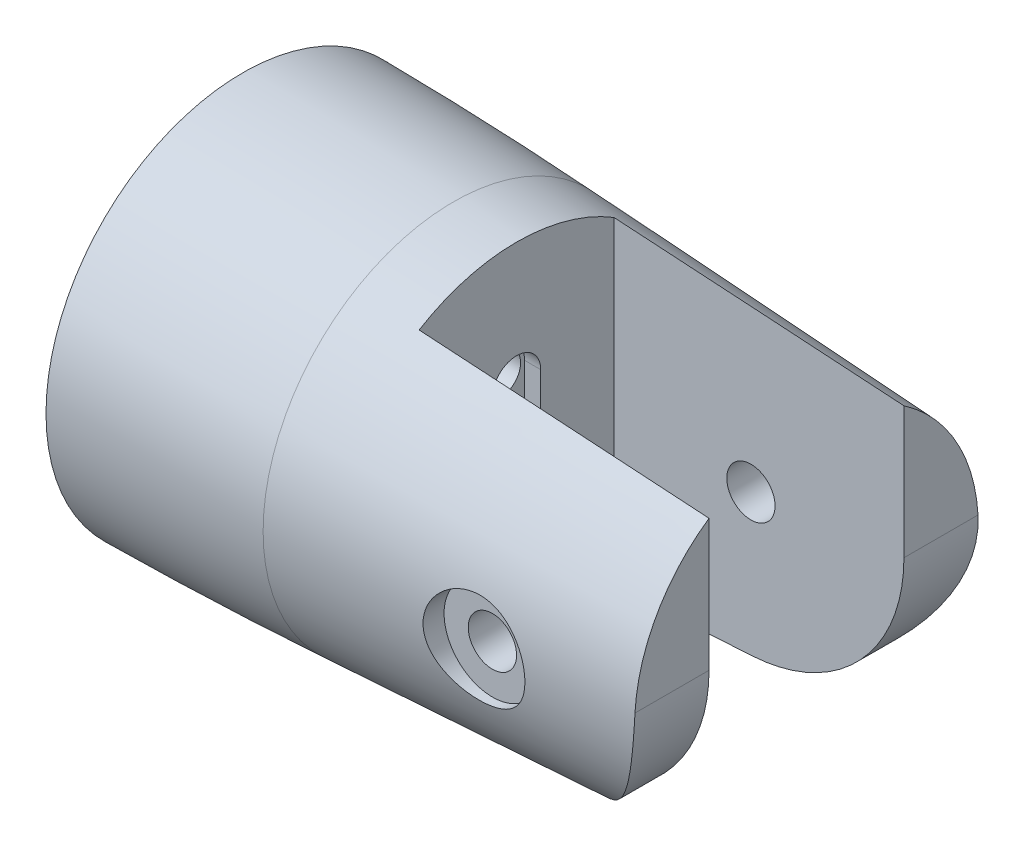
ISO-10303-21;
HEADER;
FILE_DESCRIPTION(('STEP AP214'),'2;1');
FILE_NAME('part.step','',(''),(''),'','','');
FILE_SCHEMA(('AUTOMOTIVE_DESIGN { 1 0 10303 214 1 1 1 1 }'));
ENDSEC;
DATA;
#1=APPLICATION_CONTEXT('core data for automotive mechanical design processes');
#2=APPLICATION_PROTOCOL_DEFINITION('international standard','automotive_design',2000,#1);
#3=PRODUCT_CONTEXT('',#1,'mechanical');
#4=PRODUCT('Part','Part','',(#3));
#5=PRODUCT_RELATED_PRODUCT_CATEGORY('part','',(#4));
#6=PRODUCT_DEFINITION_FORMATION('','',#4);
#7=PRODUCT_DEFINITION_CONTEXT('part definition',#1,'design');
#8=PRODUCT_DEFINITION('design','',#6,#7);
#9=PRODUCT_DEFINITION_SHAPE('','',#8);
#10=(LENGTH_UNIT() NAMED_UNIT(*) SI_UNIT(.MILLI.,.METRE.));
#11=(NAMED_UNIT(*) PLANE_ANGLE_UNIT() SI_UNIT($,.RADIAN.));
#12=(NAMED_UNIT(*) SI_UNIT($,.STERADIAN.) SOLID_ANGLE_UNIT());
#13=UNCERTAINTY_MEASURE_WITH_UNIT(LENGTH_MEASURE(1.E-05),#10,'distance_accuracy_value','');
#14=(GEOMETRIC_REPRESENTATION_CONTEXT(3) GLOBAL_UNCERTAINTY_ASSIGNED_CONTEXT((#13)) GLOBAL_UNIT_ASSIGNED_CONTEXT((#10,
#11,#12)) REPRESENTATION_CONTEXT('',''));
#15=CARTESIAN_POINT('',(0.,0.,0.));
#16=DIRECTION('',(0.,0.,1.));
#17=DIRECTION('',(1.,0.,0.));
#18=AXIS2_PLACEMENT_3D('',#15,#16,#17);
#19=CARTESIAN_POINT('',(-2.62045474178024,0.,0.));
#20=DIRECTION('',(-1.,0.,0.));
#21=DIRECTION('',(0.,0.,1.));
#22=AXIS2_PLACEMENT_3D('',#19,#20,#21);
#23=DEGENERATE_TOROIDAL_SURFACE('',#22,287.774371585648,300.,.F.);
#24=CARTESIAN_POINT('',(13.0803321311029,0.,0.));
#25=DIRECTION('',(-1.,0.,0.));
#26=DIRECTION('',(0.,0.,1.));
#27=AXIS2_PLACEMENT_3D('',#24,#25,#26);
#28=CIRCLE('',#27,11.8144888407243);
#29=CARTESIAN_POINT('',(13.0803321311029,0.,11.8144888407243));
#30=VERTEX_POINT('',#29);
#31=EDGE_CURVE('E317',#30,#30,#28,.F.);
#32=ORIENTED_EDGE('',*,*,#31,.F.);
#33=EDGE_LOOP('',(#32));
#34=FACE_BOUND('',#33,.T.);
#35=CARTESIAN_POINT('',(0.,0.,0.));
#36=DIRECTION('',(-1.,0.,0.));
#37=DIRECTION('',(0.,0.,1.));
#38=AXIS2_PLACEMENT_3D('',#35,#36,#37);
#39=CIRCLE('',#38,12.2141835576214);
#40=CARTESIAN_POINT('',(0.,0.,12.2141835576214));
#41=VERTEX_POINT('',#40);
#42=EDGE_CURVE('E174',#41,#41,#39,.F.);
#43=ORIENTED_EDGE('',*,*,#42,.T.);
#44=EDGE_LOOP('',(#43));
#45=FACE_BOUND('',#44,.T.);
#46=ADVANCED_FACE('F33',(#34,#45),#23,.F.);
#47=CARTESIAN_POINT('',(0.,0.,0.));
#48=DIRECTION('',(-1.,0.,0.));
#49=DIRECTION('',(0.,0.,-1.));
#50=AXIS2_PLACEMENT_3D('',#47,#48,#49);
#51=CONICAL_SURFACE('',#50,12.5,0.05235987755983);
#52=CARTESIAN_POINT('',(31.9092800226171,2.39438326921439,-10.5596465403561));
#53=CARTESIAN_POINT('',(29.3329511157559,2.39438326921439,-10.6980843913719));
#54=CARTESIAN_POINT('',(26.756615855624,2.39438326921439,-10.8364038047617));
#55=CARTESIAN_POINT('',(21.6039326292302,2.39438326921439,-11.1128057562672));
#56=CARTESIAN_POINT('',(19.0275846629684,2.39438326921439,-11.2508882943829));
#57=CARTESIAN_POINT('',(16.451230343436,2.39438326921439,-11.3888523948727));
#58=B_SPLINE_CURVE_WITH_KNOTS('',3,(#52,#53,#54,#55,#56,#57),.UNSPECIFIED.,.F.,.F.,(4,2,4),(0.,
7.74013699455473,15.4802739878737),.UNSPECIFIED.);
#59=CARTESIAN_POINT('',(27.2320508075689,2.39438326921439,-10.8108493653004));
#60=VERTEX_POINT('',#59);
#61=CARTESIAN_POINT('',(23.7679491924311,2.39438326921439,-10.9967211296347));
#62=VERTEX_POINT('',#61);
#63=EDGE_CURVE('E40',#60,#62,#58,.T.);
#64=ORIENTED_EDGE('',*,*,#63,.T.);
#65=CARTESIAN_POINT('',(22.1874988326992,-0.343037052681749,0.));
#66=DIRECTION('',(-0.866025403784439,0.499999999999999,0.));
#67=DIRECTION('',(-0.499999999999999,-0.866025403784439,0.));
#68=AXIS2_PLACEMENT_3D('',#65,#66,#67);
#69=ELLIPSE('',#68,13.0910737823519,11.3320115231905);
#70=CARTESIAN_POINT('',(22.0358983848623,-0.605616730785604,-11.328971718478));
#71=VERTEX_POINT('',#70);
#72=EDGE_CURVE('E11',#62,#71,#69,.T.);
#73=ORIENTED_EDGE('',*,*,#72,.T.);
#74=CARTESIAN_POINT('',(21.4875520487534,0.344146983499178,0.));
#75=DIRECTION('',(-0.866025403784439,-0.5,0.));
#76=DIRECTION('',(-0.5,0.866025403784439,0.));
#77=AXIS2_PLACEMENT_3D('',#74,#75,#76);
#78=ELLIPSE('',#77,13.1334312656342,11.3686773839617);
#79=CARTESIAN_POINT('',(23.7679491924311,-3.6056167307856,-10.6611666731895));
#80=VERTEX_POINT('',#79);
#81=EDGE_CURVE('E154',#71,#80,#78,.T.);
#82=ORIENTED_EDGE('',*,*,#81,.T.);
#83=CARTESIAN_POINT('',(16.4827479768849,-3.6056167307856,-11.0634585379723));
#84=CARTESIAN_POINT('',(19.0588843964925,-3.6056167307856,-10.9214828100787));
#85=CARTESIAN_POINT('',(21.6350044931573,-3.6056167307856,-10.7792121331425));
#86=CARTESIAN_POINT('',(26.7872120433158,-3.6056167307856,-10.4940808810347));
#87=CARTESIAN_POINT('',(29.3632994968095,-3.6056167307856,-10.3512203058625));
#88=CARTESIAN_POINT('',(31.9393706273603,-3.6056167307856,-10.2080647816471));
#89=B_SPLINE_CURVE_WITH_KNOTS('',3,(#83,#84,#85,#86,#87,#88),.UNSPECIFIED.,.F.,.F.,(4,2,4),(0.,
7.74013703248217,15.4802740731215),.UNSPECIFIED.);
#90=CARTESIAN_POINT('',(27.2320508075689,-3.6056167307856,-10.4693391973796));
#91=VERTEX_POINT('',#90);
#92=EDGE_CURVE('E627',#80,#91,#89,.T.);
#93=ORIENTED_EDGE('',*,*,#92,.T.);
#94=CARTESIAN_POINT('',(29.1220508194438,-0.332040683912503,0.));
#95=DIRECTION('',(0.866025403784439,-0.5,0.));
#96=DIRECTION('',(-0.5,-0.866025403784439,0.));
#97=AXIS2_PLACEMENT_3D('',#94,#95,#96);
#98=ELLIPSE('',#97,12.6714273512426,10.9687534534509);
#99=CARTESIAN_POINT('',(28.9641016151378,-0.605616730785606,-10.9653443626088));
#100=VERTEX_POINT('',#99);
#101=EDGE_CURVE('E624',#91,#100,#98,.T.);
#102=ORIENTED_EDGE('',*,*,#101,.T.);
#103=CARTESIAN_POINT('',(28.4221040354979,0.333150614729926,0.));
#104=DIRECTION('',(0.866025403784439,0.5,0.));
#105=DIRECTION('',(-0.5,0.866025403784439,0.));
#106=AXIS2_PLACEMENT_3D('',#103,#104,#105);
#107=ELLIPSE('',#106,12.713784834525,11.0054193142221);
#108=EDGE_CURVE('E621',#100,#60,#107,.T.);
#109=ORIENTED_EDGE('',*,*,#108,.T.);
#110=EDGE_LOOP('',(#64,#73,#82,#93,#102,#109));
#111=FACE_BOUND('',#110,.T.);
#112=CARTESIAN_POINT('',(34.999999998,0.611339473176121,-10.6481928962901));
#113=CARTESIAN_POINT('',(35.000003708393,0.496093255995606,-10.6548109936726));
#114=CARTESIAN_POINT('',(34.9980117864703,0.380761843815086,-10.65965758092));
#115=CARTESIAN_POINT('',(34.9900348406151,0.150147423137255,-10.6658167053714));
#116=CARTESIAN_POINT('',(34.9840499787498,0.0348644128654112,-10.6671293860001));
#117=CARTESIAN_POINT('',(34.9601165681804,-0.310401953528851,-10.6657813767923));
#118=CARTESIAN_POINT('',(34.9361892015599,-0.539999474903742,-10.6578458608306));
#119=CARTESIAN_POINT('',(34.8729231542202,-0.994362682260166,-10.6283850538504));
#120=CARTESIAN_POINT('',(34.833701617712,-1.21915171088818,-10.6069623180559));
#121=CARTESIAN_POINT('',(34.740395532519,-1.66401947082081,-10.5512766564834));
#122=CARTESIAN_POINT('',(34.6863095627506,-1.88409774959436,-10.517012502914));
#123=CARTESIAN_POINT('',(34.564179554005,-2.317521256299,-10.4366206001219));
#124=CARTESIAN_POINT('',(34.4961689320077,-2.53088121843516,-10.3905211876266));
#125=CARTESIAN_POINT('',(34.3469569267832,-2.95031713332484,-10.2874320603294));
#126=CARTESIAN_POINT('',(34.2657496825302,-3.15638979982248,-10.230437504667));
#127=CARTESIAN_POINT('',(34.0909823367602,-3.56049932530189,-10.1066207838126));
#128=CARTESIAN_POINT('',(33.9974061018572,-3.75852523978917,-10.0397857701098));
#129=CARTESIAN_POINT('',(33.798900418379,-4.14561210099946,-9.89751874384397));
#130=CARTESIAN_POINT('',(33.6939685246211,-4.33467110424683,-9.82208487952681));
#131=CARTESIAN_POINT('',(33.4348225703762,-4.76827283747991,-9.63593817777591));
#132=CARTESIAN_POINT('',(33.27626452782,-5.00891480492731,-9.52215504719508));
#133=CARTESIAN_POINT('',(32.9418815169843,-5.4722988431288,-9.28396530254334));
#134=CARTESIAN_POINT('',(32.7660507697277,-5.69503487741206,-9.15955513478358));
#135=CARTESIAN_POINT('',(32.3982337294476,-6.12279645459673,-8.90272889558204));
#136=CARTESIAN_POINT('',(32.2062110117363,-6.32777984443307,-8.77029497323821));
#137=CARTESIAN_POINT('',(31.8074657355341,-6.71937932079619,-8.50065424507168));
#138=CARTESIAN_POINT('',(31.6007449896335,-6.90599766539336,-8.36344802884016));
#139=CARTESIAN_POINT('',(31.1689705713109,-7.26439679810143,-8.08466670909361));
#140=CARTESIAN_POINT('',(30.9436365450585,-7.4358141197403,-7.94305872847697));
#141=CARTESIAN_POINT('',(30.4783128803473,-7.75955205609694,-7.66185498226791));
#142=CARTESIAN_POINT('',(30.2383183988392,-7.91186630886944,-7.52225990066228));
#143=CARTESIAN_POINT('',(29.7437671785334,-8.19669338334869,-7.25000050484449));
#144=CARTESIAN_POINT('',(29.489238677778,-8.3292429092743,-7.11732364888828));
#145=CARTESIAN_POINT('',(28.9647665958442,-8.57386902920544,-6.86471015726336));
#146=CARTESIAN_POINT('',(28.6948362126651,-8.68596281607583,-6.74476285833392));
#147=CARTESIAN_POINT('',(28.0943088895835,-8.90424389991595,-6.5079066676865));
#148=CARTESIAN_POINT('',(27.76086860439,-9.00669391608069,-6.39447790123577));
#149=CARTESIAN_POINT('',(27.246495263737,-9.13485304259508,-6.25692471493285));
#150=CARTESIAN_POINT('',(27.0729943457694,-9.17327364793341,-6.21654895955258));
#151=CARTESIAN_POINT('',(26.721828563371,-9.24113040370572,-6.14850788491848));
#152=CARTESIAN_POINT('',(26.5441666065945,-9.27057263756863,-6.12083395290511));
#153=CARTESIAN_POINT('',(26.2425522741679,-9.31213414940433,-6.08631641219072));
#154=CARTESIAN_POINT('',(26.1193736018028,-9.32678738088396,-6.07565352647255));
#155=CARTESIAN_POINT('',(25.8718990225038,-9.35155762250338,-6.06132788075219));
#156=CARTESIAN_POINT('',(25.7476013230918,-9.36166512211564,-6.05767974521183));
#157=CARTESIAN_POINT('',(25.6231234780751,-9.36942750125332,-6.05770601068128));
#158=B_SPLINE_CURVE_WITH_KNOTS('',3,(#112,#113,#114,#115,#116,#117,#118,#119,#120,#121,#122,
#123,#124,#125,#126,#127,#128,#129,#130,#131,#132,#133,#134,#135,#136,#137,#138,#139,#140,#141,
#142,#143,#144,#145,#146,#147,#148,#149,#150,#151,#152,#153,#154,#155,#156,#157),.UNSPECIFIED.,
.F.,.F.,(4,2,2,2,2,2,2,2,2,2,2,2,2,2,2,2,2,2,2,2,2,2,4),(0.,0.346244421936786,0.692474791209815,
1.38434636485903,2.07101953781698,2.75775838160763,3.44286808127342,4.12828289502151,
4.81460071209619,5.5010666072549,6.42922038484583,7.35768576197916,8.28829853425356,
9.21879673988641,10.1675729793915,11.1166643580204,12.0639706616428,13.0104770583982,
14.1066630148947,14.6527893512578,15.1985448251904,15.5717920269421,15.9458165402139),.UNSPECIFIED.);
#159=CARTESIAN_POINT('',(35.,0.611139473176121,-10.6482043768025));
#160=VERTEX_POINT('',#159);
#161=CARTESIAN_POINT('',(25.6233234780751,-9.36941501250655,-6.05770602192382));
#162=VERTEX_POINT('',#161);
#163=EDGE_CURVE('E258',#160,#162,#158,.T.);
#164=ORIENTED_EDGE('',*,*,#163,.T.);
#165=CARTESIAN_POINT('',(26.0000000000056,-9.3458901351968,0.));
#166=DIRECTION('',(-0.0623323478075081,0.998055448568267,0.));
#167=DIRECTION('',(-0.998055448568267,-0.0623323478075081,0.));
#168=AXIS2_PLACEMENT_3D('',#165,#166,#167);
#169=ELLIPSE('',#168,178.677655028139,6.057719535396);
#170=CARTESIAN_POINT('',(17.,-9.90797426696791,-6.05));
#171=VERTEX_POINT('',#170);
#172=EDGE_CURVE('E435',#162,#171,#169,.T.);
#173=ORIENTED_EDGE('',*,*,#172,.T.);
#174=CARTESIAN_POINT('',(17.,0.,0.));
#175=DIRECTION('',(-1.,0.,0.));
#176=DIRECTION('',(0.,0.,1.));
#177=AXIS2_PLACEMENT_3D('',#174,#175,#176);
#178=CIRCLE('',#177,11.6090677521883);
#179=CARTESIAN_POINT('',(17.,-9.90797426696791,6.05));
#180=VERTEX_POINT('',#179);
#181=EDGE_CURVE('E310',#171,#180,#178,.T.);
#182=ORIENTED_EDGE('',*,*,#181,.T.);
#183=CARTESIAN_POINT('',(25.6233234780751,-9.36941501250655,6.05770602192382));
#184=VERTEX_POINT('',#183);
#185=EDGE_CURVE('E434',#180,#184,#169,.T.);
#186=ORIENTED_EDGE('',*,*,#185,.T.);
#187=CARTESIAN_POINT('',(25.6231234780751,-9.36942750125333,6.05770601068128));
#188=CARTESIAN_POINT('',(25.8031203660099,-9.35823356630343,6.05757431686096));
#189=CARTESIAN_POINT('',(25.9827020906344,-9.34209174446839,6.0652692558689));
#190=CARTESIAN_POINT('',(26.3391777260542,-9.30039397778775,6.09503567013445));
#191=CARTESIAN_POINT('',(26.5160767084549,-9.27485896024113,6.11707526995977));
#192=CARTESIAN_POINT('',(26.863555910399,-9.21524621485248,6.17384268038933));
#193=CARTESIAN_POINT('',(27.0341908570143,-9.18130014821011,6.20837840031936));
#194=CARTESIAN_POINT('',(27.3710804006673,-9.105228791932,6.28840388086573));
#195=CARTESIAN_POINT('',(27.5373321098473,-9.06309825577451,6.33390067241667));
#196=CARTESIAN_POINT('',(27.9358016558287,-8.95131261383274,6.4556494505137));
#197=CARTESIAN_POINT('',(28.1654288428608,-8.87763650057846,6.53669010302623));
#198=CARTESIAN_POINT('',(28.6141797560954,-8.71595305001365,6.7122984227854));
#199=CARTESIAN_POINT('',(28.8332990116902,-8.62793968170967,6.80687178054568));
#200=CARTESIAN_POINT('',(29.2630512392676,-8.43773140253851,7.00609455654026));
#201=CARTESIAN_POINT('',(29.4735981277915,-8.3354242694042,7.11082147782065));
#202=CARTESIAN_POINT('',(29.8846318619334,-8.11780332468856,7.32617727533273));
#203=CARTESIAN_POINT('',(30.085119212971,-8.00249016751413,7.43680585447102));
#204=CARTESIAN_POINT('',(30.5439984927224,-7.71713777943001,7.69992967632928));
#205=CARTESIAN_POINT('',(30.7984795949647,-7.5419508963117,7.85369067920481));
#206=CARTESIAN_POINT('',(31.290212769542,-7.16886517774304,8.16140937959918));
#207=CARTESIAN_POINT('',(31.5274589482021,-6.97095863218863,8.31536712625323));
#208=CARTESIAN_POINT('',(31.9834086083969,-6.55316737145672,8.61843071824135));
#209=CARTESIAN_POINT('',(32.2021692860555,-6.33335540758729,8.76755057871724));
#210=CARTESIAN_POINT('',(32.620700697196,-5.87129848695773,9.05733124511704));
#211=CARTESIAN_POINT('',(32.8204792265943,-5.62906282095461,9.19799551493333));
#212=CARTESIAN_POINT('',(33.1516329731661,-5.18601401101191,9.43317859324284));
#213=CARTESIAN_POINT('',(33.2875935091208,-4.99005903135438,9.53041971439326));
#214=CARTESIAN_POINT('',(33.5467595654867,-4.58602099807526,9.71627291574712));
#215=CARTESIAN_POINT('',(33.6699681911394,-4.37794091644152,9.80488709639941));
#216=CARTESIAN_POINT('',(33.9025114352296,-3.95006598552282,9.97184402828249));
#217=CARTESIAN_POINT('',(34.0118402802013,-3.73026631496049,10.0501825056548));
#218=CARTESIAN_POINT('',(34.2152550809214,-3.27989026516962,10.1948492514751));
#219=CARTESIAN_POINT('',(34.3093415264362,-3.04931423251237,10.2611779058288));
#220=CARTESIAN_POINT('',(34.4818452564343,-2.57612951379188,10.3808215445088));
#221=CARTESIAN_POINT('',(34.5600858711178,-2.33341918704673,10.4339911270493));
#222=CARTESIAN_POINT('',(34.6983416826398,-1.83994530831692,10.5248635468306));
#223=CARTESIAN_POINT('',(34.7583532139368,-1.5891801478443,10.5625632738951));
#224=CARTESIAN_POINT('',(34.8588895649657,-1.08261155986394,10.6211266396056));
#225=CARTESIAN_POINT('',(34.8994710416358,-0.826825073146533,10.6420393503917));
#226=CARTESIAN_POINT('',(34.9606458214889,-0.312200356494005,10.6663258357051));
#227=CARTESIAN_POINT('',(34.9812578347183,-0.0533652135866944,10.6697160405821));
#228=CARTESIAN_POINT('',(34.9945193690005,0.27322133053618,10.6627307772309));
#229=CARTESIAN_POINT('',(34.9965774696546,0.340901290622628,10.6606733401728));
#230=CARTESIAN_POINT('',(34.9993173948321,0.476175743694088,10.6553430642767));
#231=CARTESIAN_POINT('',(35.0000005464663,0.543770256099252,10.6520714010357));
#232=CARTESIAN_POINT('',(34.999999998,0.611339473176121,10.6481928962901));
#233=B_SPLINE_CURVE_WITH_KNOTS('',3,(#187,#188,#189,#190,#191,#192,#193,#194,#195,#196,#197,
#198,#199,#200,#201,#202,#203,#204,#205,#206,#207,#208,#209,#210,#211,#212,#213,#214,#215,#216,
#217,#218,#219,#220,#221,#222,#223,#224,#225,#226,#227,#228,#229,#230,#231,#232),.UNSPECIFIED.,
.F.,.F.,(4,2,2,2,2,2,2,2,2,2,2,2,2,2,2,2,2,2,2,2,2,2,4),(0.,0.540636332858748,1.08007539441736,
1.61155188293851,2.14337019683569,2.90535409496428,3.66765935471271,4.43632643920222,
5.20495486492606,6.23899785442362,7.27339279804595,8.30446012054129,9.33510213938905,
10.1071285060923,10.8789664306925,11.6511243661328,12.423257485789,13.2035754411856,
13.9840502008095,14.7622350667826,15.5396901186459,15.7429023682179,15.9459183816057),.UNSPECIFIED.);
#234=CARTESIAN_POINT('',(35.,0.611139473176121,10.6482043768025));
#235=VERTEX_POINT('',#234);
#236=EDGE_CURVE('E251',#184,#235,#233,.T.);
#237=ORIENTED_EDGE('',*,*,#236,.T.);
#238=CARTESIAN_POINT('',(35.,0.,0.));
#239=DIRECTION('',(1.,0.,0.));
#240=DIRECTION('',(0.,0.,-1.));
#241=AXIS2_PLACEMENT_3D('',#238,#239,#240);
#242=CIRCLE('',#241,10.6657277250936);
#243=CARTESIAN_POINT('',(35.,8.78380600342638,6.05));
#244=VERTEX_POINT('',#243);
#245=EDGE_CURVE('E300',#244,#235,#242,.T.);
#246=ORIENTED_EDGE('',*,*,#245,.F.);
#247=CARTESIAN_POINT('',(-0.0578929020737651,10.9418170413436,6.05));
#248=CARTESIAN_POINT('',(3.53792488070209,10.7264454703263,6.05));
#249=CARTESIAN_POINT('',(7.13365867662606,10.5096553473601,6.05));
#250=CARTESIAN_POINT('',(14.3249325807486,10.0724937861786,6.05));
#251=CARTESIAN_POINT('',(17.9204726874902,9.85212232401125,6.05));
#252=CARTESIAN_POINT('',(23.3135826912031,9.51832310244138,6.05));
#253=CARTESIAN_POINT('',(25.1112529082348,9.40651634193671,6.05));
#254=CARTESIAN_POINT('',(28.7065163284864,9.1816939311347,6.05));
#255=CARTESIAN_POINT('',(30.5041095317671,9.0686782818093,6.05));
#256=CARTESIAN_POINT('',(34.0991996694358,8.8412986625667,6.05));
#257=CARTESIAN_POINT('',(35.8966966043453,8.72693470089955,6.05));
#258=CARTESIAN_POINT('',(39.4915983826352,8.49668908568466,6.05));
#259=CARTESIAN_POINT('',(41.2890032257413,8.38080742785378,6.05));
#260=CARTESIAN_POINT('',(45.5354204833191,8.1050008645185,6.05));
#261=CARTESIAN_POINT('',(47.9843852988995,7.94434185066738,6.05));
#262=CARTESIAN_POINT('',(52.8820614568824,7.61921955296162,6.05));
#263=CARTESIAN_POINT('',(55.3307727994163,7.45475627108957,6.05));
#264=CARTESIAN_POINT('',(60.2278527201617,7.12120542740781,6.05));
#265=CARTESIAN_POINT('',(62.6762213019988,6.9521179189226,6.05));
#266=CARTESIAN_POINT('',(67.5725633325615,6.60820931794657,6.05));
#267=CARTESIAN_POINT('',(70.0205367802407,6.43338821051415,6.05));
#268=CARTESIAN_POINT('',(74.9161051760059,6.07644452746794,6.05));
#269=CARTESIAN_POINT('',(77.3637000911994,5.89432149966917,6.04999999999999));
#270=CARTESIAN_POINT('',(82.2581494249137,5.52053856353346,6.04999999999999));
#271=CARTESIAN_POINT('',(84.7050038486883,5.32887872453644,6.04999999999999));
#272=CARTESIAN_POINT('',(88.3745461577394,5.0315242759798,6.04999999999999));
#273=CARTESIAN_POINT('',(89.597633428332,4.93075944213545,6.04999999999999));
#274=CARTESIAN_POINT('',(92.0434723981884,4.72526252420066,6.04999999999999));
#275=CARTESIAN_POINT('',(93.2662240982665,4.62053044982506,6.04999999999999));
#276=CARTESIAN_POINT('',(95.711335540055,4.40623027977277,6.04999999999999));
#277=CARTESIAN_POINT('',(96.933695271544,4.29666206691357,6.04999999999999));
#278=CARTESIAN_POINT('',(98.7668208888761,4.12776224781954,6.04999999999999));
#279=CARTESIAN_POINT('',(99.3777963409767,4.07070414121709,6.04999999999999));
#280=CARTESIAN_POINT('',(100.599584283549,3.9548577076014,6.04999999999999));
#281=CARTESIAN_POINT('',(101.210396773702,3.89606937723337,6.04999999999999));
#282=CARTESIAN_POINT('',(101.821114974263,3.83630878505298,6.04999999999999));
#283=B_SPLINE_CURVE_WITH_KNOTS('',3,(#247,#248,#249,#250,#251,#252,#253,#254,#255,#256,#257,
#258,#259,#260,#261,#262,#263,#264,#265,#266,#267,#268,#269,#270,#271,#272,#273,#274,#275,#276,
#277,#278,#279,#280,#281,#282),.UNSPECIFIED.,.F.,.F.,(4,2,2,2,2,2,2,2,2,2,2,2,2,2,2,2,2,4),(0.,
10.8067868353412,21.6136459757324,27.0170769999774,32.4205036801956,37.8238973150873,
43.2273062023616,50.5899906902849,57.952671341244,65.3152671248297,72.6778820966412,
80.0409537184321,87.4039718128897,91.0856598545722,94.7673388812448,98.4491071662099,
100.290006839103,102.130910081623),.UNSPECIFIED.);
#284=CARTESIAN_POINT('',(17.,9.90797426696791,6.05));
#285=VERTEX_POINT('',#284);
#286=EDGE_CURVE('E286',#244,#285,#283,.F.);
#287=ORIENTED_EDGE('',*,*,#286,.T.);
#288=CARTESIAN_POINT('',(17.,9.90797426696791,-6.05));
#289=VERTEX_POINT('',#288);
#290=EDGE_CURVE('E307',#285,#289,#178,.T.);
#291=ORIENTED_EDGE('',*,*,#290,.T.);
#292=CARTESIAN_POINT('',(-0.057892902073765,10.9418170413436,-6.05));
#293=CARTESIAN_POINT('',(3.5379248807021,10.7264454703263,-6.05));
#294=CARTESIAN_POINT('',(7.13365867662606,10.5096553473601,-6.05));
#295=CARTESIAN_POINT('',(14.3249325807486,10.0724937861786,-6.05));
#296=CARTESIAN_POINT('',(17.9204726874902,9.85212232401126,-6.05));
#297=CARTESIAN_POINT('',(23.3135826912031,9.51832310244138,-6.05));
#298=CARTESIAN_POINT('',(25.1112529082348,9.40651634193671,-6.05));
#299=CARTESIAN_POINT('',(28.7065163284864,9.1816939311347,-6.05));
#300=CARTESIAN_POINT('',(30.5041095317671,9.0686782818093,-6.05));
#301=CARTESIAN_POINT('',(34.0991996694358,8.8412986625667,-6.05));
#302=CARTESIAN_POINT('',(35.8966966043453,8.72693470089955,-6.05));
#303=CARTESIAN_POINT('',(39.4915983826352,8.49668908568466,-6.05));
#304=CARTESIAN_POINT('',(41.2890032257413,8.38080742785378,-6.05));
#305=CARTESIAN_POINT('',(45.5354204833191,8.1050008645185,-6.05));
#306=CARTESIAN_POINT('',(47.9843852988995,7.94434185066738,-6.05));
#307=CARTESIAN_POINT('',(52.8820614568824,7.61921955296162,-6.05));
#308=CARTESIAN_POINT('',(55.3307727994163,7.45475627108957,-6.05));
#309=CARTESIAN_POINT('',(60.2278527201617,7.1212054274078,-6.05));
#310=CARTESIAN_POINT('',(62.6762213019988,6.9521179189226,-6.05));
#311=CARTESIAN_POINT('',(67.5725633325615,6.60820931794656,-6.05));
#312=CARTESIAN_POINT('',(70.0205367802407,6.43338821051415,-6.05));
#313=CARTESIAN_POINT('',(74.9161051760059,6.07644452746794,-6.05));
#314=CARTESIAN_POINT('',(77.3637000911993,5.89432149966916,-6.05));
#315=CARTESIAN_POINT('',(82.2581494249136,5.52053856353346,-6.05));
#316=CARTESIAN_POINT('',(84.7050038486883,5.32887872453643,-6.05000000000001));
#317=CARTESIAN_POINT('',(88.3745461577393,5.03152427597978,-6.05000000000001));
#318=CARTESIAN_POINT('',(89.5976334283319,4.93075944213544,-6.05000000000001));
#319=CARTESIAN_POINT('',(92.0434723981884,4.72526252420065,-6.05000000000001));
#320=CARTESIAN_POINT('',(93.2662240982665,4.62053044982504,-6.05000000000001));
#321=CARTESIAN_POINT('',(95.711335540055,4.40623027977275,-6.05000000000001));
#322=CARTESIAN_POINT('',(96.933695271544,4.29666206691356,-6.05000000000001));
#323=CARTESIAN_POINT('',(98.7668208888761,4.12776224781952,-6.05000000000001));
#324=CARTESIAN_POINT('',(99.3777963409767,4.07070414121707,-6.05000000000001));
#325=CARTESIAN_POINT('',(100.599584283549,3.95485770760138,-6.05000000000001));
#326=CARTESIAN_POINT('',(101.210396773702,3.89606937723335,-6.05000000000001));
#327=CARTESIAN_POINT('',(101.821114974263,3.83630878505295,-6.05000000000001));
#328=B_SPLINE_CURVE_WITH_KNOTS('',3,(#292,#293,#294,#295,#296,#297,#298,#299,#300,#301,#302,
#303,#304,#305,#306,#307,#308,#309,#310,#311,#312,#313,#314,#315,#316,#317,#318,#319,#320,#321,
#322,#323,#324,#325,#326,#327),.UNSPECIFIED.,.F.,.F.,(4,2,2,2,2,2,2,2,2,2,2,2,2,2,2,2,2,4),(0.,
10.8067868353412,21.6136459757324,27.0170769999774,32.4205036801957,37.8238973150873,
43.2273062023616,50.5899906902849,57.952671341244,65.3152671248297,72.6778820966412,
80.0409537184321,87.4039718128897,91.0856598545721,94.7673388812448,98.4491071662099,
100.290006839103,102.130910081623),.UNSPECIFIED.);
#329=CARTESIAN_POINT('',(35.,8.78380600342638,-6.05));
#330=VERTEX_POINT('',#329);
#331=EDGE_CURVE('E294',#289,#330,#328,.T.);
#332=ORIENTED_EDGE('',*,*,#331,.T.);
#333=EDGE_CURVE('E293',#160,#330,#242,.T.);
#334=ORIENTED_EDGE('',*,*,#333,.F.);
#335=EDGE_LOOP('',(#164,#173,#182,#186,#237,#246,#287,#291,#332,#334));
#336=FACE_BOUND('',#335,.T.);
#337=ORIENTED_EDGE('',*,*,#31,.T.);
#338=EDGE_LOOP('',(#337));
#339=FACE_BOUND('',#338,.T.);
#340=CARTESIAN_POINT('',(23.3836229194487,-2.73186884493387,10.9385378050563));
#341=CARTESIAN_POINT('',(23.5032969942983,-2.85098334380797,10.9023250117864));
#342=CARTESIAN_POINT('',(23.633048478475,-2.95999410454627,10.865965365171));
#343=CARTESIAN_POINT('',(23.909566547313,-3.15496132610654,10.7958734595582));
#344=CARTESIAN_POINT('',(24.0563403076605,-3.24090801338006,10.7621423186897));
#345=CARTESIAN_POINT('',(24.3635651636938,-3.38725375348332,10.7000988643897));
#346=CARTESIAN_POINT('',(24.5240404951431,-3.44760636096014,10.6717964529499));
#347=CARTESIAN_POINT('',(24.8540342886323,-3.54024883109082,10.6231983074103));
#348=CARTESIAN_POINT('',(25.0235486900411,-3.57255118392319,10.6028990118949));
#349=CARTESIAN_POINT('',(25.3599404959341,-3.60692804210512,10.5726271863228));
#350=CARTESIAN_POINT('',(25.5266717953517,-3.61010870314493,10.5622902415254));
#351=CARTESIAN_POINT('',(25.8586581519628,-3.58873871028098,10.5511946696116));
#352=CARTESIAN_POINT('',(26.0239134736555,-3.56419312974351,10.5504342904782));
#353=CARTESIAN_POINT('',(26.3417064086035,-3.48956723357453,10.5578039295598));
#354=CARTESIAN_POINT('',(26.4944886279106,-3.44048721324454,10.5655989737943));
#355=CARTESIAN_POINT('',(26.7898494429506,-3.31888103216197,10.5882040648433));
#356=CARTESIAN_POINT('',(26.9324269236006,-3.24635231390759,10.6030148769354));
#357=CARTESIAN_POINT('',(27.2065981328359,-3.07824916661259,10.6380872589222));
#358=CARTESIAN_POINT('',(27.3379072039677,-2.98223329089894,10.6584542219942));
#359=CARTESIAN_POINT('',(27.5830673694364,-2.77058121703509,10.7021483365));
#360=CARTESIAN_POINT('',(27.6969143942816,-2.65494045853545,10.7254761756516));
#361=CARTESIAN_POINT('',(27.9088705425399,-2.40165269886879,10.7736988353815));
#362=CARTESIAN_POINT('',(28.0061108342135,-2.26328203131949,10.7986182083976));
#363=CARTESIAN_POINT('',(28.1761230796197,-1.9719308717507,10.8465446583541));
#364=CARTESIAN_POINT('',(28.2488937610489,-1.81894962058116,10.8695516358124));
#365=CARTESIAN_POINT('',(28.368267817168,-1.50119288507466,10.9116747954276));
#366=CARTESIAN_POINT('',(28.4146651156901,-1.33633556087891,10.9307596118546));
#367=CARTESIAN_POINT('',(28.478789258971,-1.00059570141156,10.9632136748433));
#368=CARTESIAN_POINT('',(28.4965212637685,-0.829714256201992,10.9765839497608));
#369=CARTESIAN_POINT('',(28.5024745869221,-0.491370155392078,10.9965478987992));
#370=CARTESIAN_POINT('',(28.4914278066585,-0.323929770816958,11.0033037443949));
#371=CARTESIAN_POINT('',(28.4415655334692,0.0068942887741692,11.0106817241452));
#372=CARTESIAN_POINT('',(28.4027519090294,0.170278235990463,11.01130427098));
#373=CARTESIAN_POINT('',(28.2991817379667,0.486095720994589,11.0072923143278));
#374=CARTESIAN_POINT('',(28.2347784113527,0.63864631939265,11.0027278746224));
#375=CARTESIAN_POINT('',(28.0818755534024,0.930981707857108,10.9898998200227));
#376=CARTESIAN_POINT('',(27.9933738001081,1.07076531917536,10.9816358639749));
#377=CARTESIAN_POINT('',(27.793341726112,1.33564680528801,10.963160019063));
#378=CARTESIAN_POINT('',(27.6815121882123,1.46051694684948,10.9529229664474));
#379=CARTESIAN_POINT('',(27.4386301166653,1.68994964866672,10.932759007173));
#380=CARTESIAN_POINT('',(27.3075761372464,1.79451068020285,10.9228321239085));
#381=CARTESIAN_POINT('',(27.0282167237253,1.98148849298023,10.9053572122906));
#382=CARTESIAN_POINT('',(26.8797346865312,2.06364443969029,10.8978370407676));
#383=CARTESIAN_POINT('',(26.5709264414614,2.20182366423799,10.8872760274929));
#384=CARTESIAN_POINT('',(26.4106016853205,2.25785013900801,10.8842346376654));
#385=CARTESIAN_POINT('',(26.0849333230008,2.34154286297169,10.8839950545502));
#386=CARTESIAN_POINT('',(25.9196823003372,2.36956903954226,10.8867212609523));
#387=CARTESIAN_POINT('',(25.5870483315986,2.39776121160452,10.8983975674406));
#388=CARTESIAN_POINT('',(25.4196655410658,2.39792922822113,10.9073472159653));
#389=CARTESIAN_POINT('',(25.0895570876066,2.37073205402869,10.9309922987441));
#390=CARTESIAN_POINT('',(24.9267999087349,2.34368680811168,10.9456197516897));
#391=CARTESIAN_POINT('',(24.6083495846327,2.26351706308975,10.9795181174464));
#392=CARTESIAN_POINT('',(24.4526572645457,2.21038952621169,10.9987895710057));
#393=CARTESIAN_POINT('',(24.1497620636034,2.07852382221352,11.0406279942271));
#394=CARTESIAN_POINT('',(24.0027514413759,1.99936055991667,11.0632459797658));
#395=CARTESIAN_POINT('',(23.7239316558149,1.81786463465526,11.1093174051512));
#396=CARTESIAN_POINT('',(23.5921250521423,1.71552807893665,11.1327709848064));
#397=CARTESIAN_POINT('',(23.3443919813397,1.48777348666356,11.1786103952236));
#398=CARTESIAN_POINT('',(23.2288824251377,1.36189397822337,11.2009610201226));
#399=CARTESIAN_POINT('',(23.0206102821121,1.09193469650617,11.2414548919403));
#400=CARTESIAN_POINT('',(22.9278458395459,0.947856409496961,11.2595984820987));
#401=CARTESIAN_POINT('',(22.7690036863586,0.647438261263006,11.2891691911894));
#402=CARTESIAN_POINT('',(22.7025938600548,0.491282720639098,11.3006807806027));
#403=CARTESIAN_POINT('',(22.5969761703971,0.169674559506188,11.31561323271));
#404=CARTESIAN_POINT('',(22.5577602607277,0.00422470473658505,11.3190364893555));
#405=CARTESIAN_POINT('',(22.5087392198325,-0.324609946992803,11.3168619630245));
#406=CARTESIAN_POINT('',(22.4978946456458,-0.487842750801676,11.3115949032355));
#407=CARTESIAN_POINT('',(22.5027806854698,-0.813410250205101,11.2925960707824));
#408=CARTESIAN_POINT('',(22.518511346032,-0.975744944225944,11.2788642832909));
#409=CARTESIAN_POINT('',(22.575479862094,-1.29334595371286,11.2438465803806));
#410=CARTESIAN_POINT('',(22.6164688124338,-1.44866555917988,11.2226352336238));
#411=CARTESIAN_POINT('',(22.7222171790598,-1.74990876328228,11.1740158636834));
#412=CARTESIAN_POINT('',(22.786973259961,-1.89583367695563,11.1466087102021));
#413=CARTESIAN_POINT('',(22.9321823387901,-2.16370487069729,11.0898322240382));
#414=CARTESIAN_POINT('',(23.0109615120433,-2.2866356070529,11.0607961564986));
#415=CARTESIAN_POINT('',(23.1852144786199,-2.51949352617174,11.0007224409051));
#416=CARTESIAN_POINT('',(23.2806912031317,-2.62941842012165,10.969684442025));
#417=CARTESIAN_POINT('',(23.3836229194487,-2.73186884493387,10.9385378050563));
#418=B_SPLINE_CURVE_WITH_KNOTS('',3,(#340,#341,#342,#343,#344,#345,#346,#347,#348,#349,#350,
#351,#352,#353,#354,#355,#356,#357,#358,#359,#360,#361,#362,#363,#364,#365,#366,#367,#368,#369,
#370,#371,#372,#373,#374,#375,#376,#377,#378,#379,#380,#381,#382,#383,#384,#385,#386,#387,#388,
#389,#390,#391,#392,#393,#394,#395,#396,#397,#398,#399,#400,#401,#402,#403,#404,#405,#406,#407,
#408,#409,#410,#411,#412,#413,#414,#415,#416,#417),.UNSPECIFIED.,.T.,.F.,(4,2,2,2,2,2,2,2,2,2,2,
2,2,2,2,2,2,2,2,2,2,2,2,2,2,2,2,2,2,2,2,2,2,2,2,2,2,2,4),(0.,0.517556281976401,1.03533153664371,
1.55404241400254,2.07252220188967,2.57122241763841,3.06983139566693,3.54959276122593,
4.02940647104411,4.51904416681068,5.00879579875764,5.5192525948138,6.02973592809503,
6.54415509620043,7.05848165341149,7.55985630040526,8.06119721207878,8.55584588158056,
9.05054017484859,9.55201986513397,10.0535372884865,10.560665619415,11.0677318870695,
11.5681928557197,12.068617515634,12.563226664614,13.0578934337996,13.5610749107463,
14.0643409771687,14.5787659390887,15.0931489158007,15.6008265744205,16.1083539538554,
16.5970083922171,17.0856636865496,17.5695789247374,18.0534262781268,18.4984984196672,
18.943648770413),.UNSPECIFIED.);
#419=CARTESIAN_POINT('',(23.3836229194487,-2.73186884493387,10.9385378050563));
#420=VERTEX_POINT('',#419);
#421=EDGE_CURVE('E218',#420,#420,#418,.T.);
#422=ORIENTED_EDGE('',*,*,#421,.F.);
#423=EDGE_LOOP('',(#422));
#424=FACE_BOUND('',#423,.T.);
#425=ADVANCED_FACE('F263',(#111,#336,#339,#424),#51,.T.);
#426=CARTESIAN_POINT('',(25.5,-0.605616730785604,-12.5));
#427=DIRECTION('',(0.,0.,1.));
#428=DIRECTION('',(1.,0.,0.));
#429=AXIS2_PLACEMENT_3D('',#426,#427,#428);
#430=CYLINDRICAL_SURFACE('',#429,1.5);
#431=CARTESIAN_POINT('',(25.5,-0.605616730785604,6.05));
#432=DIRECTION('',(0.,0.,1.));
#433=DIRECTION('',(1.,0.,0.));
#434=AXIS2_PLACEMENT_3D('',#431,#432,#433);
#435=CIRCLE('',#434,1.5);
#436=CARTESIAN_POINT('',(27.,-0.605616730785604,6.05));
#437=VERTEX_POINT('',#436);
#438=EDGE_CURVE('E238',#437,#437,#435,.T.);
#439=ORIENTED_EDGE('',*,*,#438,.F.);
#440=EDGE_LOOP('',(#439));
#441=FACE_BOUND('',#440,.T.);
#442=CARTESIAN_POINT('',(25.5,-0.605616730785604,10.));
#443=DIRECTION('',(0.,0.,1.));
#444=DIRECTION('',(1.,0.,0.));
#445=AXIS2_PLACEMENT_3D('',#442,#443,#444);
#446=CIRCLE('',#445,1.5);
#447=CARTESIAN_POINT('',(27.,-0.605616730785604,10.));
#448=VERTEX_POINT('',#447);
#449=EDGE_CURVE('E201',#448,#448,#446,.F.);
#450=ORIENTED_EDGE('',*,*,#449,.F.);
#451=EDGE_LOOP('',(#450));
#452=FACE_BOUND('',#451,.T.);
#453=ADVANCED_FACE('F367',(#441,#452),#430,.F.);
#454=CARTESIAN_POINT('',(35.,4.,0.));
#455=DIRECTION('',(-1.,0.,0.));
#456=DIRECTION('',(0.,0.,1.));
#457=AXIS2_PLACEMENT_3D('',#454,#455,#456);
#458=CYLINDRICAL_SURFACE('',#457,1.25);
#459=CARTESIAN_POINT('',(0.,4.,0.));
#460=DIRECTION('',(-1.,0.,0.));
#461=DIRECTION('',(0.,0.,1.));
#462=AXIS2_PLACEMENT_3D('',#459,#460,#461);
#463=CIRCLE('',#462,1.25);
#464=CARTESIAN_POINT('',(0.,4.,1.25));
#465=VERTEX_POINT('',#464);
#466=EDGE_CURVE('E177',#465,#465,#463,.F.);
#467=ORIENTED_EDGE('',*,*,#466,.F.);
#468=EDGE_LOOP('',(#467));
#469=FACE_BOUND('',#468,.T.);
#470=CARTESIAN_POINT('',(16.,4.,0.));
#471=DIRECTION('',(1.,0.,0.));
#472=DIRECTION('',(0.,0.,-1.));
#473=AXIS2_PLACEMENT_3D('',#470,#471,#472);
#474=CIRCLE('',#473,1.25);
#475=CARTESIAN_POINT('',(16.,4.,-1.25));
#476=VERTEX_POINT('',#475);
#477=EDGE_CURVE('E234',#476,#476,#474,.T.);
#478=ORIENTED_EDGE('',*,*,#477,.T.);
#479=EDGE_LOOP('',(#478));
#480=FACE_BOUND('',#479,.T.);
#481=ADVANCED_FACE('F364',(#469,#480),#458,.F.);
#482=CARTESIAN_POINT('',(35.,-4.,0.));
#483=DIRECTION('',(-1.,0.,0.));
#484=DIRECTION('',(0.,0.,1.));
#485=AXIS2_PLACEMENT_3D('',#482,#483,#484);
#486=CYLINDRICAL_SURFACE('',#485,1.25);
#487=CARTESIAN_POINT('',(0.,-4.,0.));
#488=DIRECTION('',(-1.,0.,0.));
#489=DIRECTION('',(0.,0.,1.));
#490=AXIS2_PLACEMENT_3D('',#487,#488,#489);
#491=CIRCLE('',#490,1.25);
#492=CARTESIAN_POINT('',(0.,-4.,1.25));
#493=VERTEX_POINT('',#492);
#494=EDGE_CURVE('E398',#493,#493,#491,.F.);
#495=ORIENTED_EDGE('',*,*,#494,.F.);
#496=EDGE_LOOP('',(#495));
#497=FACE_BOUND('',#496,.T.);
#498=CARTESIAN_POINT('',(16.,-4.,0.));
#499=DIRECTION('',(1.,0.,0.));
#500=DIRECTION('',(0.,0.,-1.));
#501=AXIS2_PLACEMENT_3D('',#498,#499,#500);
#502=CIRCLE('',#501,1.25);
#503=CARTESIAN_POINT('',(16.,-4.,-1.25));
#504=VERTEX_POINT('',#503);
#505=EDGE_CURVE('E228',#504,#504,#502,.T.);
#506=ORIENTED_EDGE('',*,*,#505,.T.);
#507=EDGE_LOOP('',(#506));
#508=FACE_BOUND('',#507,.T.);
#509=ADVANCED_FACE('F360',(#497,#508),#486,.F.);
#510=CARTESIAN_POINT('',(35.,0.,0.));
#511=DIRECTION('',(1.,0.,0.));
#512=DIRECTION('',(0.,0.,-1.));
#513=AXIS2_PLACEMENT_3D('',#510,#511,#512);
#514=PLANE('',#513);
#515=ORIENTED_EDGE('',*,*,#245,.T.);
#516=DIRECTION('',(0.,0.,1.));
#517=VECTOR('',#516,1.);
#518=CARTESIAN_POINT('',(35.,0.611139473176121,-12.5));
#519=LINE('',#518,#517);
#520=CARTESIAN_POINT('',(35.,0.611139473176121,6.05));
#521=VERTEX_POINT('',#520);
#522=EDGE_CURVE('E241',#521,#235,#519,.T.);
#523=ORIENTED_EDGE('',*,*,#522,.F.);
#524=DIRECTION('',(0.,-1.,0.));
#525=VECTOR('',#524,1.);
#526=CARTESIAN_POINT('',(35.,0.,6.05));
#527=LINE('',#526,#525);
#528=EDGE_CURVE('E304',#244,#521,#527,.T.);
#529=ORIENTED_EDGE('',*,*,#528,.F.);
#530=EDGE_LOOP('',(#515,#523,#529));
#531=FACE_BOUND('',#530,.T.);
#532=ADVANCED_FACE('F363',(#531),#514,.T.);
#533=DIRECTION('',(0.,1.,0.));
#534=VECTOR('',#533,1.);
#535=CARTESIAN_POINT('',(35.,0.,-6.05));
#536=LINE('',#535,#534);
#537=CARTESIAN_POINT('',(35.,0.611139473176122,-6.05));
#538=VERTEX_POINT('',#537);
#539=EDGE_CURVE('E301',#538,#330,#536,.T.);
#540=ORIENTED_EDGE('',*,*,#539,.F.);
#541=EDGE_CURVE('E246',#160,#538,#519,.T.);
#542=ORIENTED_EDGE('',*,*,#541,.F.);
#543=ORIENTED_EDGE('',*,*,#333,.T.);
#544=EDGE_LOOP('',(#540,#542,#543));
#545=FACE_BOUND('',#544,.T.);
#546=ADVANCED_FACE('F417',(#545),#514,.T.);
#547=CARTESIAN_POINT('',(17.,-12.5,-6.05));
#548=DIRECTION('',(-1.,0.,0.));
#549=DIRECTION('',(0.,0.,1.));
#550=AXIS2_PLACEMENT_3D('',#547,#548,#549);
#551=PLANE('',#550);
#552=DIRECTION('',(0.,1.,0.));
#553=VECTOR('',#552,1.);
#554=CARTESIAN_POINT('',(17.,-4.,-1.5));
#555=LINE('',#554,#553);
#556=CARTESIAN_POINT('',(17.,-4.,-1.5));
#557=VERTEX_POINT('',#556);
#558=CARTESIAN_POINT('',(17.,4.,-1.5));
#559=VERTEX_POINT('',#558);
#560=EDGE_CURVE('E217',#557,#559,#555,.T.);
#561=ORIENTED_EDGE('',*,*,#560,.F.);
#562=CARTESIAN_POINT('',(17.,-4.,0.));
#563=DIRECTION('',(1.,0.,0.));
#564=DIRECTION('',(0.,0.,-1.));
#565=AXIS2_PLACEMENT_3D('',#562,#563,#564);
#566=CIRCLE('',#565,1.5);
#567=CARTESIAN_POINT('',(17.,-4.,1.5));
#568=VERTEX_POINT('',#567);
#569=EDGE_CURVE('E55',#568,#557,#566,.T.);
#570=ORIENTED_EDGE('',*,*,#569,.F.);
#571=DIRECTION('',(0.,-1.,0.));
#572=VECTOR('',#571,1.);
#573=CARTESIAN_POINT('',(17.,-4.,1.5));
#574=LINE('',#573,#572);
#575=CARTESIAN_POINT('',(17.,4.,1.5));
#576=VERTEX_POINT('',#575);
#577=EDGE_CURVE('E206',#576,#568,#574,.T.);
#578=ORIENTED_EDGE('',*,*,#577,.F.);
#579=CARTESIAN_POINT('',(17.,4.,0.));
#580=DIRECTION('',(1.,0.,0.));
#581=DIRECTION('',(0.,0.,-1.));
#582=AXIS2_PLACEMENT_3D('',#579,#580,#581);
#583=CIRCLE('',#582,1.5);
#584=EDGE_CURVE('E221',#559,#576,#583,.T.);
#585=ORIENTED_EDGE('',*,*,#584,.F.);
#586=EDGE_LOOP('',(#561,#570,#578,#585));
#587=FACE_BOUND('',#586,.T.);
#588=DIRECTION('',(0.,1.,0.));
#589=VECTOR('',#588,1.);
#590=CARTESIAN_POINT('',(17.,-12.5,6.05));
#591=LINE('',#590,#589);
#592=EDGE_CURVE('E421',#180,#285,#591,.T.);
#593=ORIENTED_EDGE('',*,*,#592,.F.);
#594=ORIENTED_EDGE('',*,*,#181,.F.);
#595=DIRECTION('',(0.,1.,0.));
#596=VECTOR('',#595,1.);
#597=CARTESIAN_POINT('',(17.,-12.5,-6.05));
#598=LINE('',#597,#596);
#599=EDGE_CURVE('E427',#171,#289,#598,.T.);
#600=ORIENTED_EDGE('',*,*,#599,.T.);
#601=ORIENTED_EDGE('',*,*,#290,.F.);
#602=EDGE_LOOP('',(#593,#594,#600,#601));
#603=FACE_BOUND('',#602,.T.);
#604=ADVANCED_FACE('F282',(#587,#603),#551,.F.);
#605=CARTESIAN_POINT('',(35.,-12.5,6.05));
#606=DIRECTION('',(0.,0.,1.));
#607=DIRECTION('',(1.,0.,0.));
#608=AXIS2_PLACEMENT_3D('',#605,#606,#607);
#609=PLANE('',#608);
#610=ORIENTED_EDGE('',*,*,#438,.T.);
#611=EDGE_LOOP('',(#610));
#612=FACE_BOUND('',#611,.T.);
#613=CARTESIAN_POINT('',(25.,0.61113947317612,6.05));
#614=DIRECTION('',(0.,0.,1.));
#615=DIRECTION('',(1.,0.,0.));
#616=AXIS2_PLACEMENT_3D('',#613,#614,#615);
#617=CIRCLE('',#616,10.);
#618=CARTESIAN_POINT('',(25.6233234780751,-9.36941501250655,6.05));
#619=VERTEX_POINT('',#618);
#620=EDGE_CURVE('E248',#521,#619,#617,.F.);
#621=ORIENTED_EDGE('',*,*,#620,.T.);
#622=DIRECTION('',(-0.998055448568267,-0.0623323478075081,0.));
#623=VECTOR('',#622,1.);
#624=CARTESIAN_POINT('',(34.7688113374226,-8.79824461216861,6.05));
#625=LINE('',#624,#623);
#626=EDGE_CURVE('E440',#619,#180,#625,.T.);
#627=ORIENTED_EDGE('',*,*,#626,.T.);
#628=ORIENTED_EDGE('',*,*,#592,.T.);
#629=ORIENTED_EDGE('',*,*,#286,.F.);
#630=ORIENTED_EDGE('',*,*,#528,.T.);
#631=EDGE_LOOP('',(#621,#627,#628,#629,#630));
#632=FACE_BOUND('',#631,.T.);
#633=ADVANCED_FACE('F277',(#612,#632),#609,.F.);
#634=CARTESIAN_POINT('',(35.,-12.5,-6.05));
#635=DIRECTION('',(0.,0.,-1.));
#636=DIRECTION('',(-1.,0.,0.));
#637=AXIS2_PLACEMENT_3D('',#634,#635,#636);
#638=PLANE('',#637);
#639=CARTESIAN_POINT('',(25.5,-0.605616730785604,-6.05));
#640=DIRECTION('',(0.,0.,-1.));
#641=DIRECTION('',(-1.,0.,0.));
#642=AXIS2_PLACEMENT_3D('',#639,#640,#641);
#643=CIRCLE('',#642,1.5);
#644=CARTESIAN_POINT('',(24.,-0.605616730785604,-6.05));
#645=VERTEX_POINT('',#644);
#646=EDGE_CURVE('E237',#645,#645,#643,.T.);
#647=ORIENTED_EDGE('',*,*,#646,.T.);
#648=EDGE_LOOP('',(#647));
#649=FACE_BOUND('',#648,.T.);
#650=ORIENTED_EDGE('',*,*,#599,.F.);
#651=DIRECTION('',(0.998055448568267,0.0623323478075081,0.));
#652=VECTOR('',#651,1.);
#653=CARTESIAN_POINT('',(34.7688113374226,-8.79824461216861,-6.05));
#654=LINE('',#653,#652);
#655=CARTESIAN_POINT('',(25.6233234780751,-9.36941501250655,-6.05));
#656=VERTEX_POINT('',#655);
#657=EDGE_CURVE('E314',#171,#656,#654,.T.);
#658=ORIENTED_EDGE('',*,*,#657,.T.);
#659=CARTESIAN_POINT('',(25.,0.61113947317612,-6.05));
#660=DIRECTION('',(0.,0.,-1.));
#661=DIRECTION('',(-1.,0.,0.));
#662=AXIS2_PLACEMENT_3D('',#659,#660,#661);
#663=CIRCLE('',#662,10.);
#664=EDGE_CURVE('E311',#656,#538,#663,.F.);
#665=ORIENTED_EDGE('',*,*,#664,.T.);
#666=ORIENTED_EDGE('',*,*,#539,.T.);
#667=ORIENTED_EDGE('',*,*,#331,.F.);
#668=EDGE_LOOP('',(#650,#658,#665,#666,#667));
#669=FACE_BOUND('',#668,.T.);
#670=ADVANCED_FACE('F272',(#649,#669),#638,.F.);
#671=CARTESIAN_POINT('',(25.,0.61113947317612,-12.5));
#672=DIRECTION('',(0.,0.,1.));
#673=DIRECTION('',(1.,0.,0.));
#674=AXIS2_PLACEMENT_3D('',#671,#672,#673);
#675=CYLINDRICAL_SURFACE('',#674,10.);
#676=ORIENTED_EDGE('',*,*,#541,.T.);
#677=ORIENTED_EDGE('',*,*,#664,.F.);
#678=DIRECTION('',(0.,0.,1.));
#679=VECTOR('',#678,1.);
#680=CARTESIAN_POINT('',(25.6233234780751,-9.36941501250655,-12.5));
#681=LINE('',#680,#679);
#682=EDGE_CURVE('E245',#162,#656,#681,.T.);
#683=ORIENTED_EDGE('',*,*,#682,.F.);
#684=ORIENTED_EDGE('',*,*,#163,.F.);
#685=EDGE_LOOP('',(#676,#677,#683,#684));
#686=FACE_BOUND('',#685,.T.);
#687=ADVANCED_FACE('F266',(#686),#675,.T.);
#688=CARTESIAN_POINT('',(25.6233234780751,-9.36941501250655,-12.5));
#689=DIRECTION('',(-0.0623323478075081,0.998055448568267,0.));
#690=DIRECTION('',(-0.998055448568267,-0.0623323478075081,0.));
#691=AXIS2_PLACEMENT_3D('',#688,#689,#690);
#692=PLANE('',#691);
#693=ORIENTED_EDGE('',*,*,#682,.T.);
#694=ORIENTED_EDGE('',*,*,#657,.F.);
#695=ORIENTED_EDGE('',*,*,#172,.F.);
#696=EDGE_LOOP('',(#693,#694,#695));
#697=FACE_BOUND('',#696,.T.);
#698=ADVANCED_FACE('F271',(#697),#692,.F.);
#699=ORIENTED_EDGE('',*,*,#626,.F.);
#700=EDGE_CURVE('E242',#619,#184,#681,.T.);
#701=ORIENTED_EDGE('',*,*,#700,.T.);
#702=ORIENTED_EDGE('',*,*,#185,.F.);
#703=EDGE_LOOP('',(#699,#701,#702));
#704=FACE_BOUND('',#703,.T.);
#705=ADVANCED_FACE('F275',(#704),#692,.F.);
#706=ORIENTED_EDGE('',*,*,#700,.F.);
#707=ORIENTED_EDGE('',*,*,#620,.F.);
#708=ORIENTED_EDGE('',*,*,#522,.T.);
#709=ORIENTED_EDGE('',*,*,#236,.F.);
#710=EDGE_LOOP('',(#706,#707,#708,#709));
#711=FACE_BOUND('',#710,.T.);
#712=ADVANCED_FACE('F274',(#711),#675,.T.);
#713=CARTESIAN_POINT('',(25.5,-0.605616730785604,-10.));
#714=DIRECTION('',(0.,0.,1.));
#715=DIRECTION('',(1.,0.,0.));
#716=AXIS2_PLACEMENT_3D('',#713,#714,#715);
#717=CIRCLE('',#716,1.5);
#718=CARTESIAN_POINT('',(27.,-0.605616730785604,-10.));
#719=VERTEX_POINT('',#718);
#720=EDGE_CURVE('E190',#719,#719,#717,.F.);
#721=ORIENTED_EDGE('',*,*,#720,.T.);
#722=EDGE_LOOP('',(#721));
#723=FACE_BOUND('',#722,.T.);
#724=ORIENTED_EDGE('',*,*,#646,.F.);
#725=EDGE_LOOP('',(#724));
#726=FACE_BOUND('',#725,.T.);
#727=ADVANCED_FACE('F359',(#723,#726),#430,.F.);
#728=CARTESIAN_POINT('',(16.,-4.,0.));
#729=DIRECTION('',(1.,0.,0.));
#730=DIRECTION('',(0.,0.,-1.));
#731=AXIS2_PLACEMENT_3D('',#728,#729,#730);
#732=CYLINDRICAL_SURFACE('',#731,1.5);
#733=ORIENTED_EDGE('',*,*,#569,.T.);
#734=DIRECTION('',(1.,0.,0.));
#735=VECTOR('',#734,1.);
#736=CARTESIAN_POINT('',(16.,-4.,-1.5));
#737=LINE('',#736,#735);
#738=CARTESIAN_POINT('',(16.,-4.,-1.5));
#739=VERTEX_POINT('',#738);
#740=EDGE_CURVE('E215',#739,#557,#737,.T.);
#741=ORIENTED_EDGE('',*,*,#740,.F.);
#742=CARTESIAN_POINT('',(16.,-4.,0.));
#743=DIRECTION('',(1.,0.,0.));
#744=DIRECTION('',(0.,0.,-1.));
#745=AXIS2_PLACEMENT_3D('',#742,#743,#744);
#746=CIRCLE('',#745,1.5);
#747=CARTESIAN_POINT('',(16.,-4.,1.5));
#748=VERTEX_POINT('',#747);
#749=EDGE_CURVE('E202',#748,#739,#746,.T.);
#750=ORIENTED_EDGE('',*,*,#749,.F.);
#751=DIRECTION('',(1.,0.,0.));
#752=VECTOR('',#751,1.);
#753=CARTESIAN_POINT('',(16.,-4.,1.5));
#754=LINE('',#753,#752);
#755=EDGE_CURVE('E226',#748,#568,#754,.T.);
#756=ORIENTED_EDGE('',*,*,#755,.T.);
#757=EDGE_LOOP('',(#733,#741,#750,#756));
#758=FACE_BOUND('',#757,.T.);
#759=ADVANCED_FACE('F349',(#758),#732,.F.);
#760=CARTESIAN_POINT('',(16.,-4.,1.5));
#761=DIRECTION('',(0.,0.,1.));
#762=DIRECTION('',(1.,0.,0.));
#763=AXIS2_PLACEMENT_3D('',#760,#761,#762);
#764=PLANE('',#763);
#765=ORIENTED_EDGE('',*,*,#577,.T.);
#766=ORIENTED_EDGE('',*,*,#755,.F.);
#767=DIRECTION('',(0.,-1.,0.));
#768=VECTOR('',#767,1.);
#769=CARTESIAN_POINT('',(16.,-4.,1.5));
#770=LINE('',#769,#768);
#771=CARTESIAN_POINT('',(16.,4.,1.5));
#772=VERTEX_POINT('',#771);
#773=EDGE_CURVE('E212',#772,#748,#770,.T.);
#774=ORIENTED_EDGE('',*,*,#773,.F.);
#775=DIRECTION('',(1.,0.,0.));
#776=VECTOR('',#775,1.);
#777=CARTESIAN_POINT('',(16.,4.,1.5));
#778=LINE('',#777,#776);
#779=EDGE_CURVE('E229',#772,#576,#778,.T.);
#780=ORIENTED_EDGE('',*,*,#779,.T.);
#781=EDGE_LOOP('',(#765,#766,#774,#780));
#782=FACE_BOUND('',#781,.T.);
#783=ADVANCED_FACE('F345',(#782),#764,.F.);
#784=CARTESIAN_POINT('',(16.,4.,0.));
#785=DIRECTION('',(1.,0.,0.));
#786=DIRECTION('',(0.,0.,-1.));
#787=AXIS2_PLACEMENT_3D('',#784,#785,#786);
#788=CYLINDRICAL_SURFACE('',#787,1.5);
#789=ORIENTED_EDGE('',*,*,#584,.T.);
#790=ORIENTED_EDGE('',*,*,#779,.F.);
#791=CARTESIAN_POINT('',(16.,4.,0.));
#792=DIRECTION('',(1.,0.,0.));
#793=DIRECTION('',(0.,0.,-1.));
#794=AXIS2_PLACEMENT_3D('',#791,#792,#793);
#795=CIRCLE('',#794,1.5);
#796=CARTESIAN_POINT('',(16.,4.,-1.5));
#797=VERTEX_POINT('',#796);
#798=EDGE_CURVE('E209',#797,#772,#795,.T.);
#799=ORIENTED_EDGE('',*,*,#798,.F.);
#800=DIRECTION('',(1.,0.,0.));
#801=VECTOR('',#800,1.);
#802=CARTESIAN_POINT('',(16.,4.,-1.5));
#803=LINE('',#802,#801);
#804=EDGE_CURVE('E231',#797,#559,#803,.T.);
#805=ORIENTED_EDGE('',*,*,#804,.T.);
#806=EDGE_LOOP('',(#789,#790,#799,#805));
#807=FACE_BOUND('',#806,.T.);
#808=ADVANCED_FACE('F348',(#807),#788,.F.);
#809=CARTESIAN_POINT('',(16.,-4.,-1.5));
#810=DIRECTION('',(0.,0.,-1.));
#811=DIRECTION('',(-1.,0.,0.));
#812=AXIS2_PLACEMENT_3D('',#809,#810,#811);
#813=PLANE('',#812);
#814=ORIENTED_EDGE('',*,*,#560,.T.);
#815=ORIENTED_EDGE('',*,*,#804,.F.);
#816=DIRECTION('',(0.,1.,0.));
#817=VECTOR('',#816,1.);
#818=CARTESIAN_POINT('',(16.,-4.,-1.5));
#819=LINE('',#818,#817);
#820=EDGE_CURVE('E205',#739,#797,#819,.T.);
#821=ORIENTED_EDGE('',*,*,#820,.F.);
#822=ORIENTED_EDGE('',*,*,#740,.T.);
#823=EDGE_LOOP('',(#814,#815,#821,#822));
#824=FACE_BOUND('',#823,.T.);
#825=ADVANCED_FACE('F343',(#824),#813,.F.);
#826=CARTESIAN_POINT('',(16.,-4.,0.));
#827=DIRECTION('',(1.,0.,0.));
#828=DIRECTION('',(0.,0.,-1.));
#829=AXIS2_PLACEMENT_3D('',#826,#827,#828);
#830=PLANE('',#829);
#831=ORIENTED_EDGE('',*,*,#477,.F.);
#832=EDGE_LOOP('',(#831));
#833=FACE_BOUND('',#832,.T.);
#834=ORIENTED_EDGE('',*,*,#505,.F.);
#835=EDGE_LOOP('',(#834));
#836=FACE_BOUND('',#835,.T.);
#837=ORIENTED_EDGE('',*,*,#749,.T.);
#838=ORIENTED_EDGE('',*,*,#820,.T.);
#839=ORIENTED_EDGE('',*,*,#798,.T.);
#840=ORIENTED_EDGE('',*,*,#773,.T.);
#841=EDGE_LOOP('',(#837,#838,#839,#840));
#842=FACE_BOUND('',#841,.T.);
#843=ADVANCED_FACE('F338',(#833,#836,#842),#830,.T.);
#844=CARTESIAN_POINT('',(25.5,-0.605616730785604,12.229178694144));
#845=DIRECTION('',(0.,0.,-1.));
#846=DIRECTION('',(-1.,0.,0.));
#847=AXIS2_PLACEMENT_3D('',#844,#845,#846);
#848=CYLINDRICAL_SURFACE('',#847,3.);
#849=CARTESIAN_POINT('',(25.5,-0.605616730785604,10.));
#850=DIRECTION('',(0.,0.,1.));
#851=DIRECTION('',(1.,0.,0.));
#852=AXIS2_PLACEMENT_3D('',#849,#850,#851);
#853=CIRCLE('',#852,3.);
#854=CARTESIAN_POINT('',(28.5,-0.605616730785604,10.));
#855=VERTEX_POINT('',#854);
#856=EDGE_CURVE('E198',#855,#855,#853,.T.);
#857=ORIENTED_EDGE('',*,*,#856,.F.);
#858=EDGE_LOOP('',(#857));
#859=FACE_BOUND('',#858,.T.);
#860=ORIENTED_EDGE('',*,*,#421,.T.);
#861=EDGE_LOOP('',(#860));
#862=FACE_BOUND('',#861,.T.);
#863=ADVANCED_FACE('F332',(#859,#862),#848,.F.);
#864=CARTESIAN_POINT('',(25.5,-0.605616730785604,10.));
#865=DIRECTION('',(0.,0.,1.));
#866=DIRECTION('',(1.,0.,0.));
#867=AXIS2_PLACEMENT_3D('',#864,#865,#866);
#868=PLANE('',#867);
#869=ORIENTED_EDGE('',*,*,#856,.T.);
#870=EDGE_LOOP('',(#869));
#871=FACE_BOUND('',#870,.T.);
#872=ORIENTED_EDGE('',*,*,#449,.T.);
#873=EDGE_LOOP('',(#872));
#874=FACE_BOUND('',#873,.T.);
#875=ADVANCED_FACE('F337',(#871,#874),#868,.T.);
#876=CARTESIAN_POINT('',(23.7679491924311,2.39438326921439,-12.2291786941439));
#877=DIRECTION('',(-0.866025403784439,0.499999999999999,0.));
#878=DIRECTION('',(-0.499999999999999,-0.866025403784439,0.));
#879=AXIS2_PLACEMENT_3D('',#876,#877,#878);
#880=PLANE('',#879);
#881=DIRECTION('',(0.,0.,1.));
#882=VECTOR('',#881,1.);
#883=CARTESIAN_POINT('',(23.7679491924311,2.39438326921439,-12.2291786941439));
#884=LINE('',#883,#882);
#885=CARTESIAN_POINT('',(23.7679491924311,2.39438326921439,-10.));
#886=VERTEX_POINT('',#885);
#887=EDGE_CURVE('E173',#62,#886,#884,.T.);
#888=ORIENTED_EDGE('',*,*,#887,.T.);
#889=DIRECTION('',(-0.499999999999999,-0.866025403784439,0.));
#890=VECTOR('',#889,1.);
#891=CARTESIAN_POINT('',(23.7679491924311,2.39438326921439,-10.));
#892=LINE('',#891,#890);
#893=CARTESIAN_POINT('',(22.0358983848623,-0.605616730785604,-10.));
#894=VERTEX_POINT('',#893);
#895=EDGE_CURVE('E165',#886,#894,#892,.T.);
#896=ORIENTED_EDGE('',*,*,#895,.T.);
#897=DIRECTION('',(0.,0.,1.));
#898=VECTOR('',#897,1.);
#899=CARTESIAN_POINT('',(22.0358983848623,-0.605616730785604,-12.2291786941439));
#900=LINE('',#899,#898);
#901=EDGE_CURVE('E149',#71,#894,#900,.T.);
#902=ORIENTED_EDGE('',*,*,#901,.F.);
#903=ORIENTED_EDGE('',*,*,#72,.F.);
#904=EDGE_LOOP('',(#888,#896,#902,#903));
#905=FACE_BOUND('',#904,.T.);
#906=ADVANCED_FACE('F171',(#905),#880,.F.);
#907=CARTESIAN_POINT('',(27.2320508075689,2.39438326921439,-12.2291786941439));
#908=DIRECTION('',(0.,1.,0.));
#909=DIRECTION('',(-1.,0.,0.));
#910=AXIS2_PLACEMENT_3D('',#907,#908,#909);
#911=PLANE('',#910);
#912=DIRECTION('',(0.,0.,1.));
#913=VECTOR('',#912,1.);
#914=CARTESIAN_POINT('',(27.2320508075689,2.39438326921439,-12.2291786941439));
#915=LINE('',#914,#913);
#916=CARTESIAN_POINT('',(27.2320508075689,2.39438326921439,-10.));
#917=VERTEX_POINT('',#916);
#918=EDGE_CURVE('E191',#60,#917,#915,.T.);
#919=ORIENTED_EDGE('',*,*,#918,.T.);
#920=DIRECTION('',(-1.,0.,0.));
#921=VECTOR('',#920,1.);
#922=CARTESIAN_POINT('',(27.2320508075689,2.39438326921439,-10.));
#923=LINE('',#922,#921);
#924=EDGE_CURVE('E157',#917,#886,#923,.T.);
#925=ORIENTED_EDGE('',*,*,#924,.T.);
#926=ORIENTED_EDGE('',*,*,#887,.F.);
#927=ORIENTED_EDGE('',*,*,#63,.F.);
#928=EDGE_LOOP('',(#919,#925,#926,#927));
#929=FACE_BOUND('',#928,.T.);
#930=ADVANCED_FACE('F549',(#929),#911,.F.);
#931=CARTESIAN_POINT('',(28.9641016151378,-0.605616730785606,-12.2291786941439));
#932=DIRECTION('',(0.866025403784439,0.5,0.));
#933=DIRECTION('',(-0.5,0.866025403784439,0.));
#934=AXIS2_PLACEMENT_3D('',#931,#932,#933);
#935=PLANE('',#934);
#936=DIRECTION('',(0.,0.,1.));
#937=VECTOR('',#936,1.);
#938=CARTESIAN_POINT('',(28.9641016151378,-0.605616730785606,-12.2291786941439));
#939=LINE('',#938,#937);
#940=CARTESIAN_POINT('',(28.9641016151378,-0.605616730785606,-10.));
#941=VERTEX_POINT('',#940);
#942=EDGE_CURVE('E193',#100,#941,#939,.T.);
#943=ORIENTED_EDGE('',*,*,#942,.T.);
#944=DIRECTION('',(-0.5,0.866025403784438,0.));
#945=VECTOR('',#944,1.);
#946=CARTESIAN_POINT('',(28.9641016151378,-0.605616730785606,-10.));
#947=LINE('',#946,#945);
#948=EDGE_CURVE('E185',#941,#917,#947,.T.);
#949=ORIENTED_EDGE('',*,*,#948,.T.);
#950=ORIENTED_EDGE('',*,*,#918,.F.);
#951=ORIENTED_EDGE('',*,*,#108,.F.);
#952=EDGE_LOOP('',(#943,#949,#950,#951));
#953=FACE_BOUND('',#952,.T.);
#954=ADVANCED_FACE('F557',(#953),#935,.F.);
#955=CARTESIAN_POINT('',(27.2320508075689,-3.6056167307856,-12.2291786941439));
#956=DIRECTION('',(0.866025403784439,-0.5,0.));
#957=DIRECTION('',(0.5,0.866025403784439,0.));
#958=AXIS2_PLACEMENT_3D('',#955,#956,#957);
#959=PLANE('',#958);
#960=DIRECTION('',(0.,0.,1.));
#961=VECTOR('',#960,1.);
#962=CARTESIAN_POINT('',(27.2320508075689,-3.6056167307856,-12.2291786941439));
#963=LINE('',#962,#961);
#964=CARTESIAN_POINT('',(27.2320508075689,-3.6056167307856,-10.));
#965=VERTEX_POINT('',#964);
#966=EDGE_CURVE('E195',#91,#965,#963,.T.);
#967=ORIENTED_EDGE('',*,*,#966,.T.);
#968=DIRECTION('',(0.5,0.866025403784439,0.));
#969=VECTOR('',#968,1.);
#970=CARTESIAN_POINT('',(27.2320508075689,-3.6056167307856,-10.));
#971=LINE('',#970,#969);
#972=EDGE_CURVE('E182',#965,#941,#971,.T.);
#973=ORIENTED_EDGE('',*,*,#972,.T.);
#974=ORIENTED_EDGE('',*,*,#942,.F.);
#975=ORIENTED_EDGE('',*,*,#101,.F.);
#976=EDGE_LOOP('',(#967,#973,#974,#975));
#977=FACE_BOUND('',#976,.T.);
#978=ADVANCED_FACE('F567',(#977),#959,.F.);
#979=CARTESIAN_POINT('',(23.7679491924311,-3.6056167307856,-12.2291786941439));
#980=DIRECTION('',(0.,-1.,0.));
#981=DIRECTION('',(0.,0.,-1.));
#982=AXIS2_PLACEMENT_3D('',#979,#980,#981);
#983=PLANE('',#982);
#984=DIRECTION('',(0.,0.,1.));
#985=VECTOR('',#984,1.);
#986=CARTESIAN_POINT('',(23.7679491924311,-3.6056167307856,-12.2291786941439));
#987=LINE('',#986,#985);
#988=CARTESIAN_POINT('',(23.7679491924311,-3.6056167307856,-10.));
#989=VERTEX_POINT('',#988);
#990=EDGE_CURVE('E47',#80,#989,#987,.T.);
#991=ORIENTED_EDGE('',*,*,#990,.T.);
#992=DIRECTION('',(1.,0.,0.));
#993=VECTOR('',#992,1.);
#994=CARTESIAN_POINT('',(23.7679491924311,-3.6056167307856,-10.));
#995=LINE('',#994,#993);
#996=EDGE_CURVE('E169',#989,#965,#995,.T.);
#997=ORIENTED_EDGE('',*,*,#996,.T.);
#998=ORIENTED_EDGE('',*,*,#966,.F.);
#999=ORIENTED_EDGE('',*,*,#92,.F.);
#1000=EDGE_LOOP('',(#991,#997,#998,#999));
#1001=FACE_BOUND('',#1000,.T.);
#1002=ADVANCED_FACE('F577',(#1001),#983,.F.);
#1003=CARTESIAN_POINT('',(22.0358983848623,-0.605616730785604,-12.2291786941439));
#1004=DIRECTION('',(-0.866025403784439,-0.5,0.));
#1005=DIRECTION('',(0.5,-0.866025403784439,0.));
#1006=AXIS2_PLACEMENT_3D('',#1003,#1004,#1005);
#1007=PLANE('',#1006);
#1008=ORIENTED_EDGE('',*,*,#901,.T.);
#1009=DIRECTION('',(0.5,-0.866025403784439,0.));
#1010=VECTOR('',#1009,1.);
#1011=CARTESIAN_POINT('',(22.0358983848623,-0.605616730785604,-10.));
#1012=LINE('',#1011,#1010);
#1013=EDGE_CURVE('E152',#894,#989,#1012,.T.);
#1014=ORIENTED_EDGE('',*,*,#1013,.T.);
#1015=ORIENTED_EDGE('',*,*,#990,.F.);
#1016=ORIENTED_EDGE('',*,*,#81,.F.);
#1017=EDGE_LOOP('',(#1008,#1014,#1015,#1016));
#1018=FACE_BOUND('',#1017,.T.);
#1019=ADVANCED_FACE('F151',(#1018),#1007,.F.);
#1020=CARTESIAN_POINT('',(0.,0.,-10.));
#1021=DIRECTION('',(0.,0.,1.));
#1022=DIRECTION('',(1.,0.,0.));
#1023=AXIS2_PLACEMENT_3D('',#1020,#1021,#1022);
#1024=PLANE('',#1023);
#1025=ORIENTED_EDGE('',*,*,#895,.F.);
#1026=ORIENTED_EDGE('',*,*,#924,.F.);
#1027=ORIENTED_EDGE('',*,*,#948,.F.);
#1028=ORIENTED_EDGE('',*,*,#972,.F.);
#1029=ORIENTED_EDGE('',*,*,#996,.F.);
#1030=ORIENTED_EDGE('',*,*,#1013,.F.);
#1031=EDGE_LOOP('',(#1025,#1026,#1027,#1028,#1029,#1030));
#1032=FACE_BOUND('',#1031,.T.);
#1033=ORIENTED_EDGE('',*,*,#720,.F.);
#1034=EDGE_LOOP('',(#1033));
#1035=FACE_BOUND('',#1034,.T.);
#1036=ADVANCED_FACE('F162',(#1032,#1035),#1024,.F.);
#1037=CARTESIAN_POINT('',(0.,0.,0.));
#1038=DIRECTION('',(-1.,0.,0.));
#1039=DIRECTION('',(0.,0.,1.));
#1040=AXIS2_PLACEMENT_3D('',#1037,#1038,#1039);
#1041=PLANE('',#1040);
#1042=ORIENTED_EDGE('',*,*,#42,.F.);
#1043=EDGE_LOOP('',(#1042));
#1044=FACE_BOUND('',#1043,.T.);
#1045=ORIENTED_EDGE('',*,*,#494,.T.);
#1046=EDGE_LOOP('',(#1045));
#1047=FACE_BOUND('',#1046,.T.);
#1048=ORIENTED_EDGE('',*,*,#466,.T.);
#1049=EDGE_LOOP('',(#1048));
#1050=FACE_BOUND('',#1049,.T.);
#1051=ADVANCED_FACE('F391',(#1044,#1047,#1050),#1041,.T.);
#1052=CLOSED_SHELL('',(#46,#425,#453,#481,#509,#532,#546,#604,#633,#670,#687,#698,#705,#712,
#727,#759,#783,#808,#825,#843,#863,#875,#906,#930,#954,#978,#1002,#1019,#1036,#1051));
#1053=MANIFOLD_SOLID_BREP('B2',#1052);
#1054=ADVANCED_BREP_SHAPE_REPRESENTATION('',(#18,#1053),#14);
#1055=SHAPE_DEFINITION_REPRESENTATION(#9,#1054);
ENDSEC;
END-ISO-10303-21;
